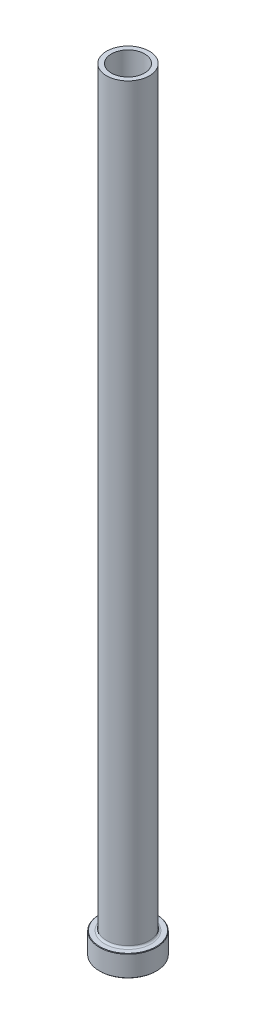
from build123d import *

# Parameters (mm, degrees)
FILLET1_R     = 0.8
CHAMFER1_SIZE = 0.2
CHAMFER3_SIZE = 0.5


with BuildPart() as part:
    # Sketch1 → Revolve1 (revolve)
    with BuildSketch(Plane.XY, mode=Mode.PRIVATE) as revolve1_sk:
        Polygon((-7, 325), (-9, 325), (-9, 9), (-12, 9), (-12, 0), (-7.25, 0), (-7.25, 258), (-7, 270), align=None)
    revolve(revolve1_sk.sketch.rotate(Axis((0, 92.187680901, 0), (0, -1, 0)), 270), axis=Axis((0, 92.187680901, 0), (0, -1, 0)))

    # Fillet1
    fillet1_edges = [part.edges().sort_by_distance(p)[0] for p in [
        (0, 9, -9),
    ]]
    fillet(fillet1_edges, radius=FILLET1_R)

    # Chamfer1
    chamfer1_edges = [part.edges().sort_by_distance(p)[0] for p in [
        (0, 0, -12),
        (0, 9, -12),
    ]]
    chamfer(chamfer1_edges, length=CHAMFER1_SIZE)

    # Chamfer3
    chamfer3_edges = [part.edges().sort_by_distance(p)[0] for p in [
        (0, 0, -7.25),
    ]]
    chamfer(chamfer3_edges, length=CHAMFER3_SIZE)


solid = part.part
